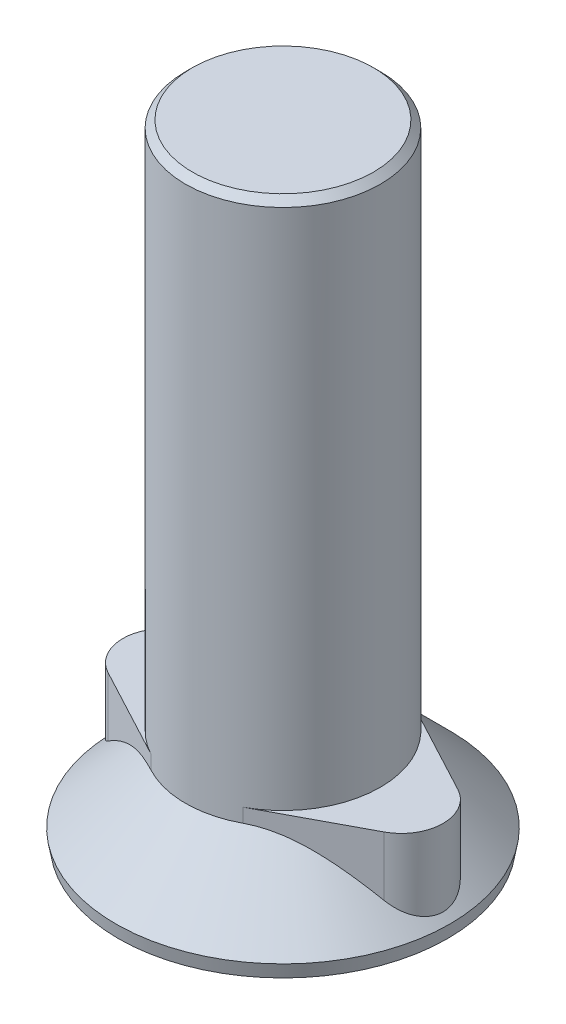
ISO-10303-21;
HEADER;
FILE_DESCRIPTION(('STEP AP214'),'2;1');
FILE_NAME('part.step','',(''),(''),'','','');
FILE_SCHEMA(('AUTOMOTIVE_DESIGN { 1 0 10303 214 1 1 1 1 }'));
ENDSEC;
DATA;
#1=APPLICATION_CONTEXT('core data for automotive mechanical design processes');
#2=APPLICATION_PROTOCOL_DEFINITION('international standard','automotive_design',2000,#1);
#3=PRODUCT_CONTEXT('',#1,'mechanical');
#4=PRODUCT('Part','Part','',(#3));
#5=PRODUCT_RELATED_PRODUCT_CATEGORY('part','',(#4));
#6=PRODUCT_DEFINITION_FORMATION('','',#4);
#7=PRODUCT_DEFINITION_CONTEXT('part definition',#1,'design');
#8=PRODUCT_DEFINITION('design','',#6,#7);
#9=PRODUCT_DEFINITION_SHAPE('','',#8);
#10=(LENGTH_UNIT() NAMED_UNIT(*) SI_UNIT(.MILLI.,.METRE.));
#11=(NAMED_UNIT(*) PLANE_ANGLE_UNIT() SI_UNIT($,.RADIAN.));
#12=(NAMED_UNIT(*) SI_UNIT($,.STERADIAN.) SOLID_ANGLE_UNIT());
#13=UNCERTAINTY_MEASURE_WITH_UNIT(LENGTH_MEASURE(1.E-05),#10,'distance_accuracy_value','');
#14=(GEOMETRIC_REPRESENTATION_CONTEXT(3) GLOBAL_UNCERTAINTY_ASSIGNED_CONTEXT((#13)) GLOBAL_UNIT_ASSIGNED_CONTEXT((#10,
#11,#12)) REPRESENTATION_CONTEXT('',''));
#15=CARTESIAN_POINT('',(0.,0.,0.));
#16=DIRECTION('',(0.,0.,1.));
#17=DIRECTION('',(1.,0.,0.));
#18=AXIS2_PLACEMENT_3D('',#15,#16,#17);
#19=CARTESIAN_POINT('',(0.,1.,0.));
#20=DIRECTION('',(0.,1.,0.));
#21=DIRECTION('',(-1.,0.,0.));
#22=AXIS2_PLACEMENT_3D('',#19,#20,#21);
#23=CONICAL_SURFACE('',#22,12.,0.174532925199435);
#24=CARTESIAN_POINT('',(0.,0.,0.));
#25=DIRECTION('',(0.,-1.,0.));
#26=DIRECTION('',(1.,0.,0.));
#27=AXIS2_PLACEMENT_3D('',#24,#25,#26);
#28=CIRCLE('',#27,11.8236730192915);
#29=CARTESIAN_POINT('',(11.8236730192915,0.,0.));
#30=VERTEX_POINT('',#29);
#31=EDGE_CURVE('E141',#30,#30,#28,.T.);
#32=ORIENTED_EDGE('',*,*,#31,.F.);
#33=EDGE_LOOP('',(#32));
#34=FACE_BOUND('',#33,.T.);
#35=CARTESIAN_POINT('',(0.,1.,0.));
#36=DIRECTION('',(0.,-1.,0.));
#37=DIRECTION('',(1.,0.,0.));
#38=AXIS2_PLACEMENT_3D('',#35,#36,#37);
#39=CIRCLE('',#38,12.);
#40=CARTESIAN_POINT('',(12.,1.,0.));
#41=VERTEX_POINT('',#40);
#42=EDGE_CURVE('E134',#41,#41,#39,.T.);
#43=ORIENTED_EDGE('',*,*,#42,.T.);
#44=EDGE_LOOP('',(#43));
#45=FACE_BOUND('',#44,.T.);
#46=ADVANCED_FACE('F16',(#34,#45),#23,.T.);
#47=CARTESIAN_POINT('',(-11.8236730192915,0.,0.));
#48=DIRECTION('',(0.,1.,0.));
#49=DIRECTION('',(-1.,0.,0.));
#50=AXIS2_PLACEMENT_3D('',#47,#48,#49);
#51=PLANE('',#50);
#52=ORIENTED_EDGE('',*,*,#31,.T.);
#53=EDGE_LOOP('',(#52));
#54=FACE_BOUND('',#53,.T.);
#55=ADVANCED_FACE('F205',(#54),#51,.F.);
#56=CARTESIAN_POINT('',(-7.,45.,0.));
#57=DIRECTION('',(0.,-1.,0.));
#58=DIRECTION('',(1.,0.,0.));
#59=AXIS2_PLACEMENT_3D('',#56,#57,#58);
#60=PLANE('',#59);
#61=CARTESIAN_POINT('',(0.,45.,0.));
#62=DIRECTION('',(0.,-1.,0.));
#63=DIRECTION('',(1.,0.,0.));
#64=AXIS2_PLACEMENT_3D('',#61,#62,#63);
#65=CIRCLE('',#64,6.5);
#66=CARTESIAN_POINT('',(6.5,45.,0.));
#67=VERTEX_POINT('',#66);
#68=EDGE_CURVE('E147',#67,#67,#65,.F.);
#69=ORIENTED_EDGE('',*,*,#68,.T.);
#70=EDGE_LOOP('',(#69));
#71=FACE_BOUND('',#70,.T.);
#72=ADVANCED_FACE('F208',(#71),#60,.F.);
#73=CARTESIAN_POINT('',(0.,0.,0.));
#74=DIRECTION('',(0.,-1.,0.));
#75=DIRECTION('',(1.,0.,0.));
#76=AXIS2_PLACEMENT_3D('',#73,#74,#75);
#77=CYLINDRICAL_SURFACE('',#76,7.);
#78=CARTESIAN_POINT('',(0.,7.,0.));
#79=DIRECTION('',(0.,1.,0.));
#80=DIRECTION('',(0.,0.,1.));
#81=AXIS2_PLACEMENT_3D('',#78,#79,#80);
#82=CIRCLE('',#81,7.);
#83=CARTESIAN_POINT('',(-3.29411764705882,7.,-6.1764705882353));
#84=VERTEX_POINT('',#83);
#85=CARTESIAN_POINT('',(-3.29411764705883,7.,6.1764705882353));
#86=VERTEX_POINT('',#85);
#87=EDGE_CURVE('E24',#84,#86,#82,.T.);
#88=ORIENTED_EDGE('',*,*,#87,.T.);
#89=DIRECTION('',(0.,1.,0.));
#90=VECTOR('',#89,1.);
#91=CARTESIAN_POINT('',(-3.29411764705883,-49.3648826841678,6.17647058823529));
#92=LINE('',#91,#90);
#93=CARTESIAN_POINT('',(-3.29411764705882,6.,6.1764705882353));
#94=VERTEX_POINT('',#93);
#95=EDGE_CURVE('E122',#94,#86,#92,.T.);
#96=ORIENTED_EDGE('',*,*,#95,.F.);
#97=CARTESIAN_POINT('',(0.,6.,0.));
#98=DIRECTION('',(0.,-1.,0.));
#99=DIRECTION('',(1.,0.,0.));
#100=AXIS2_PLACEMENT_3D('',#97,#98,#99);
#101=CIRCLE('',#100,7.);
#102=CARTESIAN_POINT('',(3.29411764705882,6.,6.17647058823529));
#103=VERTEX_POINT('',#102);
#104=EDGE_CURVE('E138',#103,#94,#101,.T.);
#105=ORIENTED_EDGE('',*,*,#104,.F.);
#106=DIRECTION('',(0.,1.,0.));
#107=VECTOR('',#106,1.);
#108=CARTESIAN_POINT('',(3.29411764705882,-49.3648826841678,6.17647058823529));
#109=LINE('',#108,#107);
#110=CARTESIAN_POINT('',(3.29411764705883,7.,6.1764705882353));
#111=VERTEX_POINT('',#110);
#112=EDGE_CURVE('E89',#103,#111,#109,.T.);
#113=ORIENTED_EDGE('',*,*,#112,.T.);
#114=CARTESIAN_POINT('',(3.29411764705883,7.,-6.17647058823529));
#115=VERTEX_POINT('',#114);
#116=EDGE_CURVE('E11',#111,#115,#82,.T.);
#117=ORIENTED_EDGE('',*,*,#116,.T.);
#118=DIRECTION('',(0.,1.,0.));
#119=VECTOR('',#118,1.);
#120=CARTESIAN_POINT('',(3.29411764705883,-49.3648826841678,-6.1764705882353));
#121=LINE('',#120,#119);
#122=CARTESIAN_POINT('',(3.29411764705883,6.,-6.1764705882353));
#123=VERTEX_POINT('',#122);
#124=EDGE_CURVE('E130',#123,#115,#121,.T.);
#125=ORIENTED_EDGE('',*,*,#124,.F.);
#126=CARTESIAN_POINT('',(-3.29411764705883,6.,-6.17647058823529));
#127=VERTEX_POINT('',#126);
#128=EDGE_CURVE('E137',#127,#123,#101,.T.);
#129=ORIENTED_EDGE('',*,*,#128,.F.);
#130=DIRECTION('',(0.,1.,0.));
#131=VECTOR('',#130,1.);
#132=CARTESIAN_POINT('',(-3.29411764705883,-49.3648826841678,-6.17647058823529));
#133=LINE('',#132,#131);
#134=EDGE_CURVE('E36',#127,#84,#133,.T.);
#135=ORIENTED_EDGE('',*,*,#134,.T.);
#136=EDGE_LOOP('',(#88,#96,#105,#113,#117,#125,#129,#135));
#137=FACE_BOUND('',#136,.T.);
#138=CARTESIAN_POINT('',(0.,44.5,0.));
#139=DIRECTION('',(0.,-1.,0.));
#140=DIRECTION('',(1.,0.,0.));
#141=AXIS2_PLACEMENT_3D('',#138,#139,#140);
#142=CIRCLE('',#141,7.);
#143=CARTESIAN_POINT('',(7.,44.5,0.));
#144=VERTEX_POINT('',#143);
#145=EDGE_CURVE('E144',#144,#144,#142,.T.);
#146=ORIENTED_EDGE('',*,*,#145,.T.);
#147=EDGE_LOOP('',(#146));
#148=FACE_BOUND('',#147,.T.);
#149=ADVANCED_FACE('F167',(#137,#148),#77,.T.);
#150=CARTESIAN_POINT('',(0.,6.,0.));
#151=DIRECTION('',(0.,-1.,0.));
#152=DIRECTION('',(1.,0.,0.));
#153=AXIS2_PLACEMENT_3D('',#150,#151,#152);
#154=CONICAL_SURFACE('',#153,7.,0.785398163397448);
#155=ORIENTED_EDGE('',*,*,#42,.F.);
#156=EDGE_LOOP('',(#155));
#157=FACE_BOUND('',#156,.T.);
#158=CARTESIAN_POINT('',(9.91156470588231,2.74102344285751,-2.6471654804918));
#159=CARTESIAN_POINT('',(9.98356228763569,2.6813690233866,-2.60875989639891));
#160=CARTESIAN_POINT('',(10.0547429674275,2.62291515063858,-2.56704011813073));
#161=CARTESIAN_POINT('',(10.1949975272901,2.50865949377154,-2.47668735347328));
#162=CARTESIAN_POINT('',(10.2640684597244,2.4528613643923,-2.42804518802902));
#163=CARTESIAN_POINT('',(10.4678434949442,2.289482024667,-2.27091453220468));
#164=CARTESIAN_POINT('',(10.5983245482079,2.18656351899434,-2.15162883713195));
#165=CARTESIAN_POINT('',(10.8179042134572,2.01545301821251,-1.91015412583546));
#166=CARTESIAN_POINT('',(10.9101511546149,1.94438047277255,-1.79284614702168));
#167=CARTESIAN_POINT('',(11.078544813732,1.81566307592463,-1.54075747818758));
#168=CARTESIAN_POINT('',(11.1547303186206,1.7579858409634,-1.40602017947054));
#169=CARTESIAN_POINT('',(11.2540827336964,1.68319667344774,-1.19219020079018));
#170=CARTESIAN_POINT('',(11.2848240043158,1.66013911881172,-1.11857608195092));
#171=CARTESIAN_POINT('',(11.3406495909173,1.61837100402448,-0.968059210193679));
#172=CARTESIAN_POINT('',(11.3657368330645,1.59965819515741,-0.89115818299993));
#173=CARTESIAN_POINT('',(11.4097950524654,1.5668557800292,-0.734643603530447));
#174=CARTESIAN_POINT('',(11.4287651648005,1.55276682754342,-0.655029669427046));
#175=CARTESIAN_POINT('',(11.4602113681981,1.52944091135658,-0.493863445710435));
#176=CARTESIAN_POINT('',(11.4726884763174,1.52020318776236,-0.412311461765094));
#177=CARTESIAN_POINT('',(11.4975567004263,1.50179903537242,-0.187528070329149));
#178=CARTESIAN_POINT('',(11.5031404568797,1.49767820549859,-0.0430304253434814));
#179=CARTESIAN_POINT('',(11.4934677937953,1.50482887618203,0.244746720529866));
#180=CARTESIAN_POINT('',(11.4782205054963,1.51609363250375,0.388026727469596));
#181=CARTESIAN_POINT('',(11.4292912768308,1.55236907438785,0.661431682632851));
#182=CARTESIAN_POINT('',(11.3966495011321,1.57660445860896,0.791849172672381));
#183=CARTESIAN_POINT('',(11.3154001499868,1.63722236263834,1.04458454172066));
#184=CARTESIAN_POINT('',(11.2667907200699,1.67360629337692,1.16690147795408));
#185=CARTESIAN_POINT('',(11.1523951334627,1.75977399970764,1.40846076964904));
#186=CARTESIAN_POINT('',(11.0857251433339,1.81025327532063,1.52703288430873));
#187=CARTESIAN_POINT('',(10.9398166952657,1.92164347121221,1.75076046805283));
#188=CARTESIAN_POINT('',(10.8605706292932,1.98256070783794,1.85590774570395));
#189=CARTESIAN_POINT('',(10.6797756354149,2.12287681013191,2.06654372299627));
#190=CARTESIAN_POINT('',(10.5766629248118,2.20367701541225,2.16974887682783));
#191=CARTESIAN_POINT('',(10.3613784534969,2.37452551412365,2.35704138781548));
#192=CARTESIAN_POINT('',(10.2492078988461,2.46457257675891,2.44113128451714));
#193=CARTESIAN_POINT('',(10.0609620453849,2.61780602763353,2.563395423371));
#194=CARTESIAN_POINT('',(9.98666376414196,2.67879336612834,2.6071233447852));
#195=CARTESIAN_POINT('',(9.91156470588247,2.74102344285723,2.64716548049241));
#196=B_SPLINE_CURVE_WITH_KNOTS('',3,(#158,#159,#160,#161,#162,#163,#164,#165,#166,#167,#168,
#169,#170,#171,#172,#173,#174,#175,#176,#177,#178,#179,#180,#181,#182,#183,#184,#185,#186,#187,
#188,#189,#190,#191,#192,#193,#194,#195),.UNSPECIFIED.,.F.,.F.,(4,2,2,2,2,2,2,2,2,2,2,2,2,2,2,2,
2,2,4),(0.,0.303094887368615,0.606595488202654,1.21685044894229,1.71086386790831,
2.20367026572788,2.45248273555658,2.70116613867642,2.94988468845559,3.19856426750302,
3.63007339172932,4.06139342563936,4.46941718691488,4.8774883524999,5.31107016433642,
5.74491528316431,6.24340392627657,6.74182630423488,7.05823895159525),.UNSPECIFIED.);
#197=CARTESIAN_POINT('',(9.91176470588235,2.74085773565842,-2.64705882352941));
#198=VERTEX_POINT('',#197);
#199=CARTESIAN_POINT('',(9.91176470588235,2.74085773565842,2.64705882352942));
#200=VERTEX_POINT('',#199);
#201=EDGE_CURVE('E188',#198,#200,#196,.T.);
#202=ORIENTED_EDGE('',*,*,#201,.T.);
#203=CARTESIAN_POINT('',(9.91196470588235,2.74069202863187,2.64695215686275));
#204=CARTESIAN_POINT('',(9.72835052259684,2.89277280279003,2.74487972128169));
#205=CARTESIAN_POINT('',(9.54352151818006,3.04301127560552,2.84345519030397));
#206=CARTESIAN_POINT('',(9.17089129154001,3.33888277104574,3.04219131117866));
#207=CARTESIAN_POINT('',(8.9830887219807,3.48451361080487,3.14235268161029));
#208=CARTESIAN_POINT('',(8.60198495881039,3.77172880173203,3.34560802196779));
#209=CARTESIAN_POINT('',(8.40864552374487,3.91324831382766,3.44872238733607));
#210=CARTESIAN_POINT('',(8.01802078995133,4.18905779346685,3.65705557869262));
#211=CARTESIAN_POINT('',(7.8207360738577,4.32334881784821,3.76227409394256));
#212=CARTESIAN_POINT('',(7.43095847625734,4.57680979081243,3.97015547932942));
#213=CARTESIAN_POINT('',(7.23867786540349,4.69639408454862,4.07270513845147));
#214=CARTESIAN_POINT('',(6.84944967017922,4.92532994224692,4.28029350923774));
#215=CARTESIAN_POINT('',(6.65250121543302,5.03467957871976,4.38533268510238));
#216=CARTESIAN_POINT('',(6.05553260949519,5.34273579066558,4.70371594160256));
#217=CARTESIAN_POINT('',(5.64740426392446,5.52279774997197,4.92138439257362));
#218=CARTESIAN_POINT('',(5.07373263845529,5.7171686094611,5.22734259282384));
#219=CARTESIAN_POINT('',(4.91678444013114,5.76456152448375,5.31104829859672));
#220=CARTESIAN_POINT('',(4.6003783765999,5.84729209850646,5.47979819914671));
#221=CARTESIAN_POINT('',(4.44092024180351,5.88262845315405,5.56484253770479));
#222=CARTESIAN_POINT('',(4.11749377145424,5.94042908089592,5.7373366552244));
#223=CARTESIAN_POINT('',(3.95349429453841,5.96267397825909,5.82480304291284));
#224=CARTESIAN_POINT('',(3.70666436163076,5.98502086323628,5.95644567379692));
#225=CARTESIAN_POINT('',(3.62420063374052,5.99063313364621,6.00042632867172));
#226=CARTESIAN_POINT('',(3.45913349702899,5.99812685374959,6.08846213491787));
#227=CARTESIAN_POINT('',(3.37653007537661,6.00000793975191,6.13251729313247));
#228=CARTESIAN_POINT('',(3.29391764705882,5.99999999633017,6.17657725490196));
#229=B_SPLINE_CURVE_WITH_KNOTS('',3,(#203,#204,#205,#206,#207,#208,#209,#210,#211,#212,#213,
#214,#215,#216,#217,#218,#219,#220,#221,#222,#223,#224,#225,#226,#227,#228),.UNSPECIFIED.,.F.,
.F.,(4,2,2,2,2,2,2,2,2,2,2,2,4),(0.,0.773261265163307,1.54688353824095,2.32930229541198,
3.11160634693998,3.85704643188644,4.60262662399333,6.08594642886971,6.63785559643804,
7.18982445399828,7.75079718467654,8.03161328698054,8.31245676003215),.UNSPECIFIED.);
#230=EDGE_CURVE('E86',#200,#103,#229,.T.);
#231=ORIENTED_EDGE('',*,*,#230,.T.);
#232=ORIENTED_EDGE('',*,*,#104,.T.);
#233=CARTESIAN_POINT('',(-3.29391764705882,5.99999999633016,6.17657725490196));
#234=CARTESIAN_POINT('',(-3.38889550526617,6.00001602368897,6.12592239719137));
#235=CARTESIAN_POINT('',(-3.48386963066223,5.99752443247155,6.07526953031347));
#236=CARTESIAN_POINT('',(-3.67360272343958,5.98761917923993,5.97407854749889));
#237=CARTESIAN_POINT('',(-3.76836172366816,5.98020632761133,5.92354041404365));
#238=CARTESIAN_POINT('',(-3.95731037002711,5.96057015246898,5.8227678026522));
#239=CARTESIAN_POINT('',(-4.05150075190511,5.94835590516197,5.77253293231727));
#240=CARTESIAN_POINT('',(-4.23931958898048,5.91929318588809,5.67236288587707));
#241=CARTESIAN_POINT('',(-4.33294802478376,5.90244455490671,5.62242772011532));
#242=CARTESIAN_POINT('',(-4.609504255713,5.84593062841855,5.47493106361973));
#243=CARTESIAN_POINT('',(-4.79144702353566,5.79993391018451,5.37789492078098));
#244=CARTESIAN_POINT('',(-5.15182380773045,5.69289389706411,5.18569396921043));
#245=CARTESIAN_POINT('',(-5.33025702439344,5.63184721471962,5.09052958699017));
#246=CARTESIAN_POINT('',(-5.70293729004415,5.48940367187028,4.89176677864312));
#247=CARTESIAN_POINT('',(-5.89673231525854,5.40649757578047,4.78840943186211));
#248=CARTESIAN_POINT('',(-6.27961985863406,5.22765030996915,4.58420274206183));
#249=CARTESIAN_POINT('',(-6.46871035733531,5.13170365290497,4.48335447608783));
#250=CARTESIAN_POINT('',(-6.84299343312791,4.9289316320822,4.28373683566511));
#251=CARTESIAN_POINT('',(-7.02817184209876,4.82207292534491,4.18497501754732));
#252=CARTESIAN_POINT('',(-7.39441126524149,4.59976813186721,3.98964732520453));
#253=CARTESIAN_POINT('',(-7.5754728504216,4.48432324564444,3.89308114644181));
#254=CARTESIAN_POINT('',(-7.94186434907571,4.24120890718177,3.69767234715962));
#255=CARTESIAN_POINT('',(-8.12703107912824,4.11322499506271,3.59891675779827));
#256=CARTESIAN_POINT('',(-8.49393723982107,3.85106887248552,3.40323347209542));
#257=CARTESIAN_POINT('',(-8.67567627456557,3.71689595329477,3.30630598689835));
#258=CARTESIAN_POINT('',(-9.03464495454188,3.4446646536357,3.11485602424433));
#259=CARTESIAN_POINT('',(-9.21189971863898,3.30664864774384,3.02032015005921));
#260=CARTESIAN_POINT('',(-9.56378667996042,3.02653602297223,2.83264710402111));
#261=CARTESIAN_POINT('',(-9.73841982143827,2.8844409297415,2.73950942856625));
#262=CARTESIAN_POINT('',(-9.91196470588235,2.74069202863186,2.64695215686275));
#263=B_SPLINE_CURVE_WITH_KNOTS('',3,(#233,#234,#235,#236,#237,#238,#239,#240,#241,#242,#243,
#244,#245,#246,#247,#248,#249,#250,#251,#252,#253,#254,#255,#256,#257,#258,#259,#260,#261,#262),
.UNSPECIFIED.,.F.,.F.,(4,2,2,2,2,2,2,2,2,2,2,2,2,2,4),(0.,0.322888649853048,0.645724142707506,
0.967952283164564,1.29019148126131,1.92328489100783,2.55652092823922,3.26028188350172,
3.96433989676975,4.67061754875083,5.37679663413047,6.11407510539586,6.85143821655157,
7.58257514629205,8.31344209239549),.UNSPECIFIED.);
#264=CARTESIAN_POINT('',(-9.91176470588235,2.7408577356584,2.64705882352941));
#265=VERTEX_POINT('',#264);
#266=EDGE_CURVE('E150',#94,#265,#263,.T.);
#267=ORIENTED_EDGE('',*,*,#266,.T.);
#268=CARTESIAN_POINT('',(-9.91156470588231,2.74102344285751,2.6471654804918));
#269=CARTESIAN_POINT('',(-9.98356228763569,2.68136902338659,2.60875989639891));
#270=CARTESIAN_POINT('',(-10.0547429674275,2.62291515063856,2.56704011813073));
#271=CARTESIAN_POINT('',(-10.1949975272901,2.50865949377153,2.47668735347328));
#272=CARTESIAN_POINT('',(-10.2640684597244,2.45286136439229,2.42804518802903));
#273=CARTESIAN_POINT('',(-10.4678434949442,2.28948202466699,2.27091453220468));
#274=CARTESIAN_POINT('',(-10.5983245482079,2.18656351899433,2.15162883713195));
#275=CARTESIAN_POINT('',(-10.8179042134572,2.0154530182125,1.91015412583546));
#276=CARTESIAN_POINT('',(-10.9101511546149,1.94438047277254,1.79284614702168));
#277=CARTESIAN_POINT('',(-11.078544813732,1.81566307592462,1.54075747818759));
#278=CARTESIAN_POINT('',(-11.1547303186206,1.75798584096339,1.40602017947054));
#279=CARTESIAN_POINT('',(-11.2540827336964,1.68319667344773,1.19219020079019));
#280=CARTESIAN_POINT('',(-11.2848240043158,1.66013911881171,1.11857608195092));
#281=CARTESIAN_POINT('',(-11.3406495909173,1.61837100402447,0.968059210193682));
#282=CARTESIAN_POINT('',(-11.3657368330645,1.5996581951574,0.891158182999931));
#283=CARTESIAN_POINT('',(-11.4097950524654,1.5668557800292,0.734643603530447));
#284=CARTESIAN_POINT('',(-11.4287651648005,1.55276682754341,0.655029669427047));
#285=CARTESIAN_POINT('',(-11.4602113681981,1.52944091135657,0.493863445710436));
#286=CARTESIAN_POINT('',(-11.4726884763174,1.52020318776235,0.412311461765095));
#287=CARTESIAN_POINT('',(-11.4975567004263,1.50179903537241,0.18752807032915));
#288=CARTESIAN_POINT('',(-11.5031404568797,1.49767820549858,0.0430304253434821));
#289=CARTESIAN_POINT('',(-11.4934677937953,1.50482887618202,-0.244746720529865));
#290=CARTESIAN_POINT('',(-11.4782205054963,1.51609363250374,-0.388026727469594));
#291=CARTESIAN_POINT('',(-11.4292912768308,1.55236907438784,-0.661431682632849));
#292=CARTESIAN_POINT('',(-11.3966495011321,1.57660445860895,-0.791849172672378));
#293=CARTESIAN_POINT('',(-11.3154001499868,1.63722236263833,-1.04458454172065));
#294=CARTESIAN_POINT('',(-11.2667907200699,1.67360629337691,-1.16690147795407));
#295=CARTESIAN_POINT('',(-11.1523951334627,1.75977399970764,-1.40846076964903));
#296=CARTESIAN_POINT('',(-11.0857251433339,1.81025327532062,-1.52703288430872));
#297=CARTESIAN_POINT('',(-10.9398166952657,1.9216434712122,-1.75076046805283));
#298=CARTESIAN_POINT('',(-10.8605706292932,1.98256070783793,-1.85590774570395));
#299=CARTESIAN_POINT('',(-10.6797756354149,2.1228768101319,-2.06654372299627));
#300=CARTESIAN_POINT('',(-10.5766629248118,2.20367701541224,-2.16974887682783));
#301=CARTESIAN_POINT('',(-10.3613784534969,2.37452551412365,-2.35704138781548));
#302=CARTESIAN_POINT('',(-10.2492078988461,2.4645725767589,-2.44113128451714));
#303=CARTESIAN_POINT('',(-10.0609620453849,2.61780602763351,-2.563395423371));
#304=CARTESIAN_POINT('',(-9.98666376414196,2.67879336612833,-2.6071233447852));
#305=CARTESIAN_POINT('',(-9.91156470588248,2.74102344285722,-2.64716548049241));
#306=B_SPLINE_CURVE_WITH_KNOTS('',3,(#268,#269,#270,#271,#272,#273,#274,#275,#276,#277,#278,
#279,#280,#281,#282,#283,#284,#285,#286,#287,#288,#289,#290,#291,#292,#293,#294,#295,#296,#297,
#298,#299,#300,#301,#302,#303,#304,#305),.UNSPECIFIED.,.F.,.F.,(4,2,2,2,2,2,2,2,2,2,2,2,2,2,2,2,
2,2,4),(0.,0.303094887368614,0.606595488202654,1.21685044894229,1.71086386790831,
2.20367026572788,2.45248273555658,2.70116613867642,2.94988468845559,3.19856426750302,
3.63007339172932,4.06139342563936,4.46941718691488,4.8774883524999,5.31107016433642,
5.74491528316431,6.24340392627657,6.74182630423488,7.05823895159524),.UNSPECIFIED.);
#307=CARTESIAN_POINT('',(-9.91176470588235,2.7408577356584,-2.64705882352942));
#308=VERTEX_POINT('',#307);
#309=EDGE_CURVE('E156',#265,#308,#306,.T.);
#310=ORIENTED_EDGE('',*,*,#309,.T.);
#311=CARTESIAN_POINT('',(-9.91196470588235,2.74069202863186,-2.64695215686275));
#312=CARTESIAN_POINT('',(-9.72835052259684,2.89277280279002,-2.74487972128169));
#313=CARTESIAN_POINT('',(-9.54352151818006,3.04301127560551,-2.84345519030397));
#314=CARTESIAN_POINT('',(-9.17089129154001,3.33888277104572,-3.04219131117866));
#315=CARTESIAN_POINT('',(-8.98308872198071,3.48451361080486,-3.14235268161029));
#316=CARTESIAN_POINT('',(-8.6019849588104,3.77172880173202,-3.34560802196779));
#317=CARTESIAN_POINT('',(-8.40864552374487,3.91324831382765,-3.44872238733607));
#318=CARTESIAN_POINT('',(-8.01802078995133,4.18905779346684,-3.65705557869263));
#319=CARTESIAN_POINT('',(-7.82073607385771,4.32334881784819,-3.76227409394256));
#320=CARTESIAN_POINT('',(-7.43095847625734,4.57680979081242,-3.97015547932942));
#321=CARTESIAN_POINT('',(-7.2386778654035,4.6963940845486,-4.07270513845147));
#322=CARTESIAN_POINT('',(-6.84944967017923,4.92532994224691,-4.28029350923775));
#323=CARTESIAN_POINT('',(-6.65250121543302,5.03467957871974,-4.38533268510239));
#324=CARTESIAN_POINT('',(-6.05553260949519,5.34273579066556,-4.70371594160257));
#325=CARTESIAN_POINT('',(-5.64740426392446,5.52279774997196,-4.92138439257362));
#326=CARTESIAN_POINT('',(-5.07373263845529,5.71716860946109,-5.22734259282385));
#327=CARTESIAN_POINT('',(-4.91678444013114,5.76456152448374,-5.31104829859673));
#328=CARTESIAN_POINT('',(-4.60037837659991,5.84729209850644,-5.47979819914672));
#329=CARTESIAN_POINT('',(-4.44092024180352,5.88262845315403,-5.5648425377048));
#330=CARTESIAN_POINT('',(-4.11749377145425,5.9404290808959,-5.73733665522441));
#331=CARTESIAN_POINT('',(-3.95349429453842,5.96267397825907,-5.82480304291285));
#332=CARTESIAN_POINT('',(-3.70666436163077,5.98502086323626,-5.95644567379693));
#333=CARTESIAN_POINT('',(-3.62420063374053,5.9906331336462,-6.00042632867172));
#334=CARTESIAN_POINT('',(-3.459133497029,5.99812685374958,-6.08846213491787));
#335=CARTESIAN_POINT('',(-3.37653007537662,6.00000793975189,-6.13251729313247));
#336=CARTESIAN_POINT('',(-3.29391764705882,5.99999999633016,-6.17657725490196));
#337=B_SPLINE_CURVE_WITH_KNOTS('',3,(#311,#312,#313,#314,#315,#316,#317,#318,#319,#320,#321,
#322,#323,#324,#325,#326,#327,#328,#329,#330,#331,#332,#333,#334,#335,#336),.UNSPECIFIED.,.F.,
.F.,(4,2,2,2,2,2,2,2,2,2,2,2,4),(0.,0.773261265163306,1.54688353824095,2.32930229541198,
3.11160634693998,3.85704643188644,4.60262662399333,6.08594642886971,6.63785559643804,
7.18982445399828,7.75079718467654,8.03161328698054,8.31245676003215),.UNSPECIFIED.);
#338=EDGE_CURVE('E176',#308,#127,#337,.T.);
#339=ORIENTED_EDGE('',*,*,#338,.T.);
#340=ORIENTED_EDGE('',*,*,#128,.T.);
#341=CARTESIAN_POINT('',(3.29391764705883,5.99999999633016,-6.17657725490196));
#342=CARTESIAN_POINT('',(3.38889550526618,6.00001602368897,-6.12592239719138));
#343=CARTESIAN_POINT('',(3.48386963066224,5.99752443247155,-6.07526953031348));
#344=CARTESIAN_POINT('',(3.67360272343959,5.98761917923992,-5.9740785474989));
#345=CARTESIAN_POINT('',(3.76836172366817,5.98020632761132,-5.92354041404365));
#346=CARTESIAN_POINT('',(3.95731037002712,5.96057015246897,-5.82276780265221));
#347=CARTESIAN_POINT('',(4.05150075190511,5.94835590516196,-5.77253293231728));
#348=CARTESIAN_POINT('',(4.23931958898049,5.91929318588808,-5.67236288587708));
#349=CARTESIAN_POINT('',(4.33294802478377,5.9024445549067,-5.62242772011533));
#350=CARTESIAN_POINT('',(4.60950425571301,5.84593062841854,-5.47493106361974));
#351=CARTESIAN_POINT('',(4.79144702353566,5.7999339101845,-5.37789492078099));
#352=CARTESIAN_POINT('',(5.15182380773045,5.6928938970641,-5.18569396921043));
#353=CARTESIAN_POINT('',(5.33025702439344,5.63184721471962,-5.09052958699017));
#354=CARTESIAN_POINT('',(5.70293729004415,5.48940367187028,-4.89176677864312));
#355=CARTESIAN_POINT('',(5.89673231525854,5.40649757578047,-4.78840943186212));
#356=CARTESIAN_POINT('',(6.27961985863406,5.22765030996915,-4.58420274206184));
#357=CARTESIAN_POINT('',(6.46871035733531,5.13170365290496,-4.48335447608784));
#358=CARTESIAN_POINT('',(6.84299343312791,4.9289316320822,-4.28373683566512));
#359=CARTESIAN_POINT('',(7.02817184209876,4.82207292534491,-4.18497501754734));
#360=CARTESIAN_POINT('',(7.39441126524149,4.59976813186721,-3.98964732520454));
#361=CARTESIAN_POINT('',(7.5754728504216,4.48432324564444,-3.89308114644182));
#362=CARTESIAN_POINT('',(7.94186434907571,4.24120890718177,-3.69767234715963));
#363=CARTESIAN_POINT('',(8.12703107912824,4.11322499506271,-3.59891675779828));
#364=CARTESIAN_POINT('',(8.49393723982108,3.85106887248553,-3.40323347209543));
#365=CARTESIAN_POINT('',(8.67567627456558,3.71689595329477,-3.30630598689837));
#366=CARTESIAN_POINT('',(9.03464495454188,3.44466465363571,-3.11485602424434));
#367=CARTESIAN_POINT('',(9.21189971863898,3.30664864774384,-3.02032015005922));
#368=CARTESIAN_POINT('',(9.56378667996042,3.02653602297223,-2.83264710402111));
#369=CARTESIAN_POINT('',(9.73841982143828,2.88444092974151,-2.73950942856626));
#370=CARTESIAN_POINT('',(9.91196470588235,2.74069202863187,-2.64695215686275));
#371=B_SPLINE_CURVE_WITH_KNOTS('',3,(#341,#342,#343,#344,#345,#346,#347,#348,#349,#350,#351,
#352,#353,#354,#355,#356,#357,#358,#359,#360,#361,#362,#363,#364,#365,#366,#367,#368,#369,#370),
.UNSPECIFIED.,.F.,.F.,(4,2,2,2,2,2,2,2,2,2,2,2,2,2,4),(0.,0.322888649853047,0.645724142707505,
0.967952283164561,1.29019148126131,1.92328489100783,2.55652092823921,3.26028188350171,
3.96433989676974,4.67061754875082,5.37679663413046,6.11407510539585,6.85143821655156,
7.58257514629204,8.31344209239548),.UNSPECIFIED.);
#372=EDGE_CURVE('E182',#123,#198,#371,.T.);
#373=ORIENTED_EDGE('',*,*,#372,.T.);
#374=EDGE_LOOP('',(#202,#231,#232,#267,#310,#339,#340,#373));
#375=FACE_BOUND('',#374,.T.);
#376=ADVANCED_FACE('F161',(#157,#375),#154,.T.);
#377=CARTESIAN_POINT('',(0.,44.5,0.));
#378=DIRECTION('',(0.,-1.,0.));
#379=DIRECTION('',(1.,0.,0.));
#380=AXIS2_PLACEMENT_3D('',#377,#378,#379);
#381=CONICAL_SURFACE('',#380,7.,0.785398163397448);
#382=ORIENTED_EDGE('',*,*,#68,.F.);
#383=EDGE_LOOP('',(#382));
#384=FACE_BOUND('',#383,.T.);
#385=ORIENTED_EDGE('',*,*,#145,.F.);
#386=EDGE_LOOP('',(#385));
#387=FACE_BOUND('',#386,.T.);
#388=ADVANCED_FACE('F166',(#384,#387),#381,.T.);
#389=CARTESIAN_POINT('',(3.29411764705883,-49.3648826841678,-6.1764705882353));
#390=DIRECTION('',(0.470588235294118,0.,-0.882352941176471));
#391=DIRECTION('',(-0.882352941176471,0.,-0.470588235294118));
#392=AXIS2_PLACEMENT_3D('',#389,#390,#391);
#393=PLANE('',#392);
#394=ORIENTED_EDGE('',*,*,#372,.F.);
#395=ORIENTED_EDGE('',*,*,#124,.T.);
#396=DIRECTION('',(-0.88235294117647,0.,-0.470588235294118));
#397=VECTOR('',#396,1.);
#398=CARTESIAN_POINT('',(3.29411764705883,7.,-6.1764705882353));
#399=LINE('',#398,#397);
#400=CARTESIAN_POINT('',(9.91176470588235,7.,-2.64705882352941));
#401=VERTEX_POINT('',#400);
#402=EDGE_CURVE('E100',#401,#115,#399,.T.);
#403=ORIENTED_EDGE('',*,*,#402,.F.);
#404=DIRECTION('',(0.,1.,0.));
#405=VECTOR('',#404,1.);
#406=CARTESIAN_POINT('',(9.91176470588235,-49.3648826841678,-2.64705882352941));
#407=LINE('',#406,#405);
#408=EDGE_CURVE('E90',#198,#401,#407,.T.);
#409=ORIENTED_EDGE('',*,*,#408,.F.);
#410=EDGE_LOOP('',(#394,#395,#403,#409));
#411=FACE_BOUND('',#410,.T.);
#412=ADVANCED_FACE('F221',(#411),#393,.T.);
#413=CARTESIAN_POINT('',(3.29411764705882,-49.3648826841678,6.17647058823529));
#414=DIRECTION('',(0.470588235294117,0.,0.882352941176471));
#415=DIRECTION('',(0.882352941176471,0.,-0.470588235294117));
#416=AXIS2_PLACEMENT_3D('',#413,#414,#415);
#417=PLANE('',#416);
#418=ORIENTED_EDGE('',*,*,#230,.F.);
#419=DIRECTION('',(0.,1.,0.));
#420=VECTOR('',#419,1.);
#421=CARTESIAN_POINT('',(9.91176470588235,-49.3648826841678,2.64705882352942));
#422=LINE('',#421,#420);
#423=CARTESIAN_POINT('',(9.91176470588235,7.,2.64705882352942));
#424=VERTEX_POINT('',#423);
#425=EDGE_CURVE('E79',#200,#424,#422,.T.);
#426=ORIENTED_EDGE('',*,*,#425,.T.);
#427=DIRECTION('',(0.882352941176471,0.,-0.470588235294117));
#428=VECTOR('',#427,1.);
#429=CARTESIAN_POINT('',(3.29411764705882,7.,6.17647058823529));
#430=LINE('',#429,#428);
#431=EDGE_CURVE('E84',#111,#424,#430,.T.);
#432=ORIENTED_EDGE('',*,*,#431,.F.);
#433=ORIENTED_EDGE('',*,*,#112,.F.);
#434=EDGE_LOOP('',(#418,#426,#432,#433));
#435=FACE_BOUND('',#434,.T.);
#436=ADVANCED_FACE('F81',(#435),#417,.T.);
#437=CARTESIAN_POINT('',(0.,7.,0.));
#438=DIRECTION('',(0.,1.,0.));
#439=DIRECTION('',(0.,0.,1.));
#440=AXIS2_PLACEMENT_3D('',#437,#438,#439);
#441=PLANE('',#440);
#442=ORIENTED_EDGE('',*,*,#116,.F.);
#443=ORIENTED_EDGE('',*,*,#431,.T.);
#444=CARTESIAN_POINT('',(8.5,7.,0.));
#445=DIRECTION('',(0.,1.,0.));
#446=DIRECTION('',(-1.,0.,0.));
#447=AXIS2_PLACEMENT_3D('',#444,#445,#446);
#448=CIRCLE('',#447,3.);
#449=EDGE_CURVE('E93',#424,#401,#448,.T.);
#450=ORIENTED_EDGE('',*,*,#449,.T.);
#451=ORIENTED_EDGE('',*,*,#402,.T.);
#452=EDGE_LOOP('',(#442,#443,#450,#451));
#453=FACE_BOUND('',#452,.T.);
#454=ADVANCED_FACE('F102',(#453),#441,.T.);
#455=CARTESIAN_POINT('',(8.5,-49.3648826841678,0.));
#456=DIRECTION('',(0.,1.,0.));
#457=DIRECTION('',(0.,0.,1.));
#458=AXIS2_PLACEMENT_3D('',#455,#456,#457);
#459=CYLINDRICAL_SURFACE('',#458,3.);
#460=ORIENTED_EDGE('',*,*,#201,.F.);
#461=ORIENTED_EDGE('',*,*,#408,.T.);
#462=ORIENTED_EDGE('',*,*,#449,.F.);
#463=ORIENTED_EDGE('',*,*,#425,.F.);
#464=EDGE_LOOP('',(#460,#461,#462,#463));
#465=FACE_BOUND('',#464,.T.);
#466=ADVANCED_FACE('F94',(#465),#459,.T.);
#467=ORIENTED_EDGE('',*,*,#87,.F.);
#468=DIRECTION('',(-0.882352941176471,0.,0.470588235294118));
#469=VECTOR('',#468,1.);
#470=CARTESIAN_POINT('',(-3.29411764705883,7.,-6.1764705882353));
#471=LINE('',#470,#469);
#472=CARTESIAN_POINT('',(-9.91176470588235,7.,-2.64705882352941));
#473=VERTEX_POINT('',#472);
#474=EDGE_CURVE('E110',#84,#473,#471,.T.);
#475=ORIENTED_EDGE('',*,*,#474,.T.);
#476=CARTESIAN_POINT('',(-8.5,7.,0.));
#477=DIRECTION('',(0.,1.,0.));
#478=DIRECTION('',(1.,0.,0.));
#479=AXIS2_PLACEMENT_3D('',#476,#477,#478);
#480=CIRCLE('',#479,3.);
#481=CARTESIAN_POINT('',(-9.91176470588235,7.,2.64705882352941));
#482=VERTEX_POINT('',#481);
#483=EDGE_CURVE('E114',#473,#482,#480,.T.);
#484=ORIENTED_EDGE('',*,*,#483,.T.);
#485=DIRECTION('',(0.882352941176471,0.,0.470588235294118));
#486=VECTOR('',#485,1.);
#487=CARTESIAN_POINT('',(-3.29411764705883,7.,6.17647058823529));
#488=LINE('',#487,#486);
#489=EDGE_CURVE('E118',#482,#86,#488,.T.);
#490=ORIENTED_EDGE('',*,*,#489,.T.);
#491=EDGE_LOOP('',(#467,#475,#484,#490));
#492=FACE_BOUND('',#491,.T.);
#493=ADVANCED_FACE('F242',(#492),#441,.T.);
#494=CARTESIAN_POINT('',(-3.29411764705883,-49.3648826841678,-6.1764705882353));
#495=DIRECTION('',(-0.470588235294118,0.,-0.882352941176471));
#496=DIRECTION('',(-0.882352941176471,0.,0.470588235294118));
#497=AXIS2_PLACEMENT_3D('',#494,#495,#496);
#498=PLANE('',#497);
#499=ORIENTED_EDGE('',*,*,#338,.F.);
#500=DIRECTION('',(0.,1.,0.));
#501=VECTOR('',#500,1.);
#502=CARTESIAN_POINT('',(-9.91176470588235,-49.3648826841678,-2.64705882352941));
#503=LINE('',#502,#501);
#504=EDGE_CURVE('E127',#308,#473,#503,.T.);
#505=ORIENTED_EDGE('',*,*,#504,.T.);
#506=ORIENTED_EDGE('',*,*,#474,.F.);
#507=ORIENTED_EDGE('',*,*,#134,.F.);
#508=EDGE_LOOP('',(#499,#505,#506,#507));
#509=FACE_BOUND('',#508,.T.);
#510=ADVANCED_FACE('F238',(#509),#498,.T.);
#511=CARTESIAN_POINT('',(-8.5,-49.3648826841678,0.));
#512=DIRECTION('',(0.,1.,0.));
#513=DIRECTION('',(0.,0.,1.));
#514=AXIS2_PLACEMENT_3D('',#511,#512,#513);
#515=CYLINDRICAL_SURFACE('',#514,3.);
#516=ORIENTED_EDGE('',*,*,#309,.F.);
#517=DIRECTION('',(0.,1.,0.));
#518=VECTOR('',#517,1.);
#519=CARTESIAN_POINT('',(-9.91176470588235,-49.3648826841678,2.64705882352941));
#520=LINE('',#519,#518);
#521=EDGE_CURVE('E125',#265,#482,#520,.T.);
#522=ORIENTED_EDGE('',*,*,#521,.T.);
#523=ORIENTED_EDGE('',*,*,#483,.F.);
#524=ORIENTED_EDGE('',*,*,#504,.F.);
#525=EDGE_LOOP('',(#516,#522,#523,#524));
#526=FACE_BOUND('',#525,.T.);
#527=ADVANCED_FACE('F241',(#526),#515,.T.);
#528=CARTESIAN_POINT('',(-3.29411764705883,-49.3648826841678,6.17647058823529));
#529=DIRECTION('',(-0.470588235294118,0.,0.882352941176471));
#530=DIRECTION('',(0.882352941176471,0.,0.470588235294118));
#531=AXIS2_PLACEMENT_3D('',#528,#529,#530);
#532=PLANE('',#531);
#533=ORIENTED_EDGE('',*,*,#266,.F.);
#534=ORIENTED_EDGE('',*,*,#95,.T.);
#535=ORIENTED_EDGE('',*,*,#489,.F.);
#536=ORIENTED_EDGE('',*,*,#521,.F.);
#537=EDGE_LOOP('',(#533,#534,#535,#536));
#538=FACE_BOUND('',#537,.T.);
#539=ADVANCED_FACE('F245',(#538),#532,.T.);
#540=CLOSED_SHELL('',(#46,#55,#72,#149,#376,#388,#412,#436,#454,#466,#493,#510,#527,#539));
#541=MANIFOLD_SOLID_BREP('B1',#540);
#542=ADVANCED_BREP_SHAPE_REPRESENTATION('',(#18,#541),#14);
#543=SHAPE_DEFINITION_REPRESENTATION(#9,#542);
ENDSEC;
END-ISO-10303-21;
